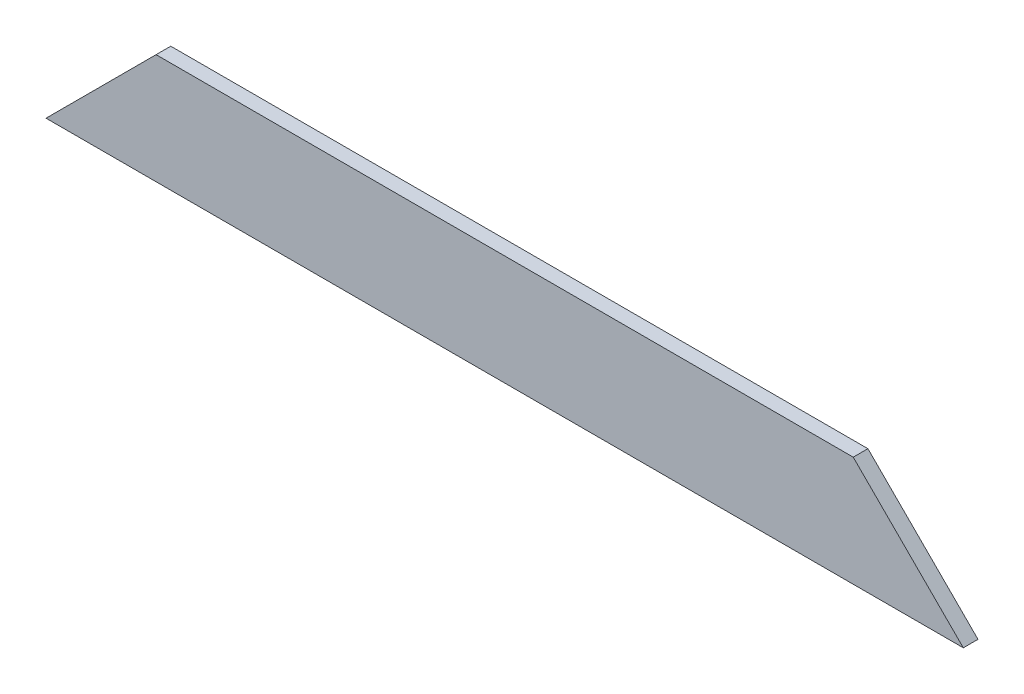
from build123d import *

# Parameters (mm, degrees)
BASE_EXTRUSION_DEPTH = 8


with BuildPart() as part:
    # Esquisse1 → Base-Extrusion (new body)
    with BuildSketch(Plane.XY):
        Polygon((0, 0), (60, 60), (440, 60), (500, 0), align=None)
    extrude(amount=BASE_EXTRUSION_DEPTH)


solid = part.part
